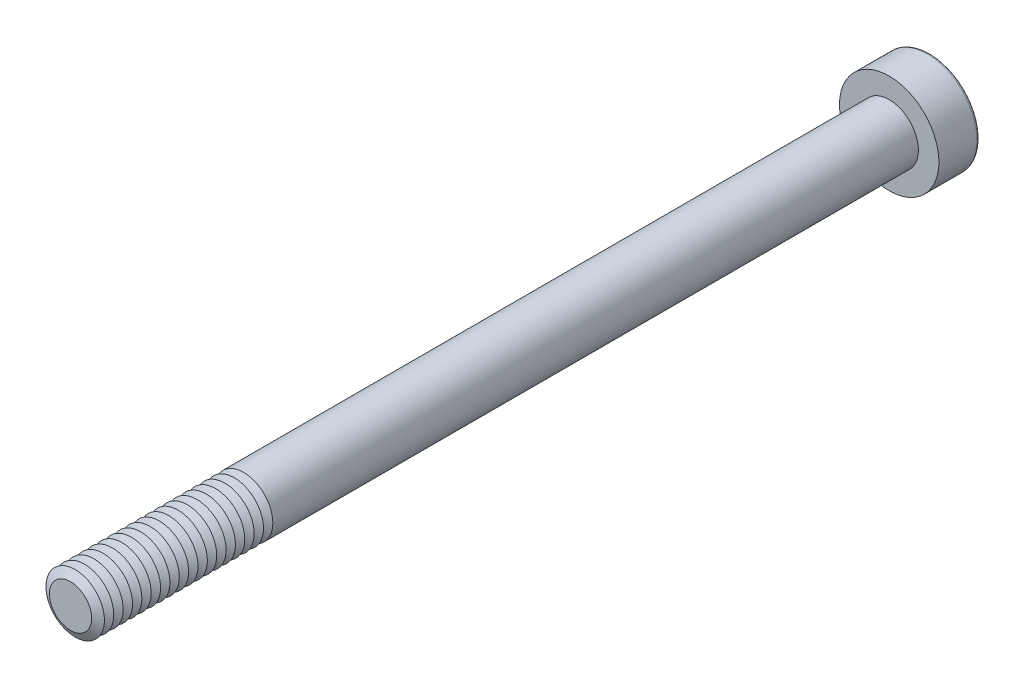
from build123d import *

# Parameters (mm, degrees)
SKETCH1_R           = 2.5
BOSS_EXTRUDE1_DEPTH = 70
SKETCH2_R           = 4.25
BOSS_EXTRUDE2_DEPTH = 3.5
CUT_EXTRUDE1_DEPTH  = 2.25
FILLET1_R           = 0.25
LPATTERN1_COUNT     = 19
LPATTERN1_PITCH     = 0.8


with BuildPart() as part:
    # Sketch1 → Boss-Extrude1 (new body)
    with BuildSketch(Plane.XY):
        Circle(SKETCH1_R)
    extrude(amount=BOSS_EXTRUDE1_DEPTH)

    # Sketch2 → Boss-Extrude2 (add)
    with BuildSketch(Plane(origin=(0, 0, 0), x_dir=(-1, 0, 0), z_dir=(0, 0, -1))):
        Circle(SKETCH2_R)
    extrude(amount=BOSS_EXTRUDE2_DEPTH)

    # Sketch3 → Cut-Extrude1 (cut)
    with BuildSketch(Plane(origin=(0, 0, -3.5), x_dir=(-1, 0, 0), z_dir=(0, 0, -1))):
        Polygon((-0.866025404, 1.5), (-1.732050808, 0), (-0.866025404, -1.5), (0.866025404, -1.5), (1.732050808, 0), (0.866025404, 1.5), align=None)
    extrude(amount=-CUT_EXTRUDE1_DEPTH, mode=Mode.SUBTRACT)

    # Fillet1
    fillet1_edges = [part.edges().sort_by_distance(p)[0] for p in [
        (4.25, 0, -3.5),
    ]]
    fillet(fillet1_edges, radius=FILLET1_R)

    # Cut-Extrude2 cone 1 section (on through the dimple's axis) → Cut-Extrude2 (revolve, cut)
    with BuildSketch(Plane(origin=(0, 0, -1.25), x_dir=(0, 1, 0), z_dir=(1, 0, 0))):
        Polygon((0, 0), (1.5, 0), (0, 0.866025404), align=None)
    revolve(axis=Axis((0, 0, -1.25), (0, 0, 1)), mode=Mode.SUBTRACT)

    # Cut-Extrude3 cone 1 section (on through the dimple's axis) → Cut-Extrude3 (revolve, cut)
    with BuildSketch(Plane(origin=(0, 0, -3.5), x_dir=(0, 1, 0), z_dir=(1, 0, 0))):
        Polygon((0, 0), (1.732050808, 0), (0, 0.464101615), align=None)
    revolve(axis=Axis((0, 0, -3.5), (0, 0, 1)), mode=Mode.SUBTRACT)

    # Sketch7 → Cut-Revolve1 (revolve, cut)
    with BuildSketch(Plane(origin=(0, 0, 0), x_dir=(0, 0, -1), z_dir=(1, 0, 0)), mode=Mode.PRIVATE) as cut_revolve1_sk:
        Polygon((-70, 1.807179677), (-69.6, 2.5), (-70.4, 2.5), align=None)
    cut_revolve1 = revolve(cut_revolve1_sk.sketch.rotate(Axis((0, 0, 70), (0, 0, -1)), 90), axis=Axis((0, 0, 70), (0, 0, -1)), mode=Mode.SUBTRACT)

    # LPattern1: Cut-Revolve1 ×19
    with Locations(*[(0, 0, -i * LPATTERN1_PITCH) for i in range(1, LPATTERN1_COUNT)]):
        add(cut_revolve1, mode=Mode.SUBTRACT)


solid = part.part
